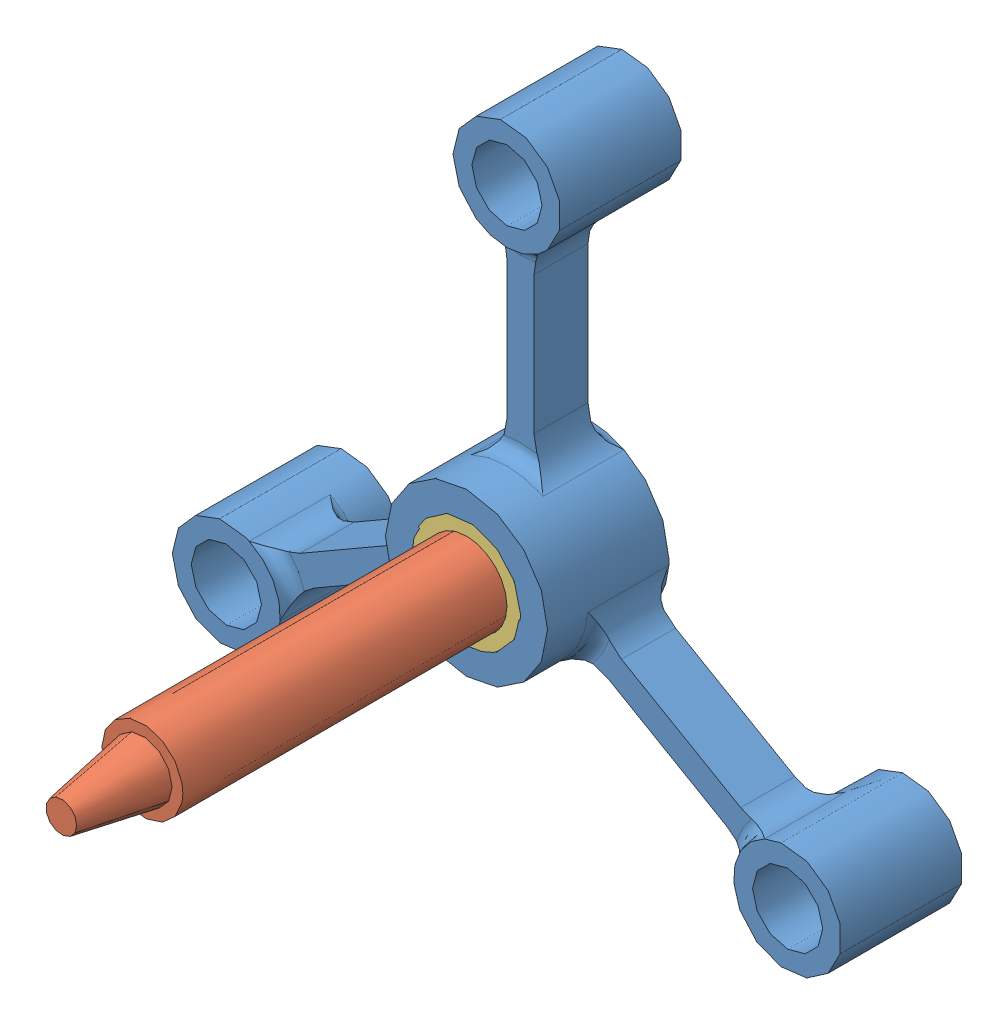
SolidWorks assembly spider.SLDASM, configuration Different geometry (file format 4700). Lengths in mm.
Overall size (157.38 139.7 133.35).
3 component instances, 3 part files, 5 mates.
Components (placement in the parent):
- spider-1: spider.SLDPRT [Default] at (0 0 -28.6004) size (157.38 139.7 38.1)
- shaft-1: shaft.SLDPRT [Default] at (0 0 -28.6004) size (19.05 19.05 120.65)
- hub-1: hub.SLDPRT [Default] at (0 0 -31.7754) size (25.4 25.4 28.57)
Mates (geometry in assembly coordinates):
- Concentric1: concentric anti-aligned: cylinder of spider-1 through (0 0 -41.3004) axis (0 0 1) radius 12.7; cylinder of hub-1 through (0 0 32.7206) axis (0 0 -1) radius 12.7
- Concentric2: concentric anti-aligned: cylinder of shaft-1 through (0 0 72.9996) axis (0 0 -1) radius 9.525; cylinder of hub-1 through (0 0 -31.7754) axis (0 0 1) radius 9.525
- Coincident3: coincident: point of ?
- Coincident5: coincident aligned: plane of spider-1 through (0 0 -31.7754) normal (0 0 -1); plane of hub-1 through (0 0 -31.7754) normal (0 0 -1)
- Distance1: distance = 3.175 mm aligned: plane of spider-1 through (0 0 -31.7754) normal (0 0 -1); plane of shaft-1 through (0 0 -28.6004) normal (0 0 -1)
